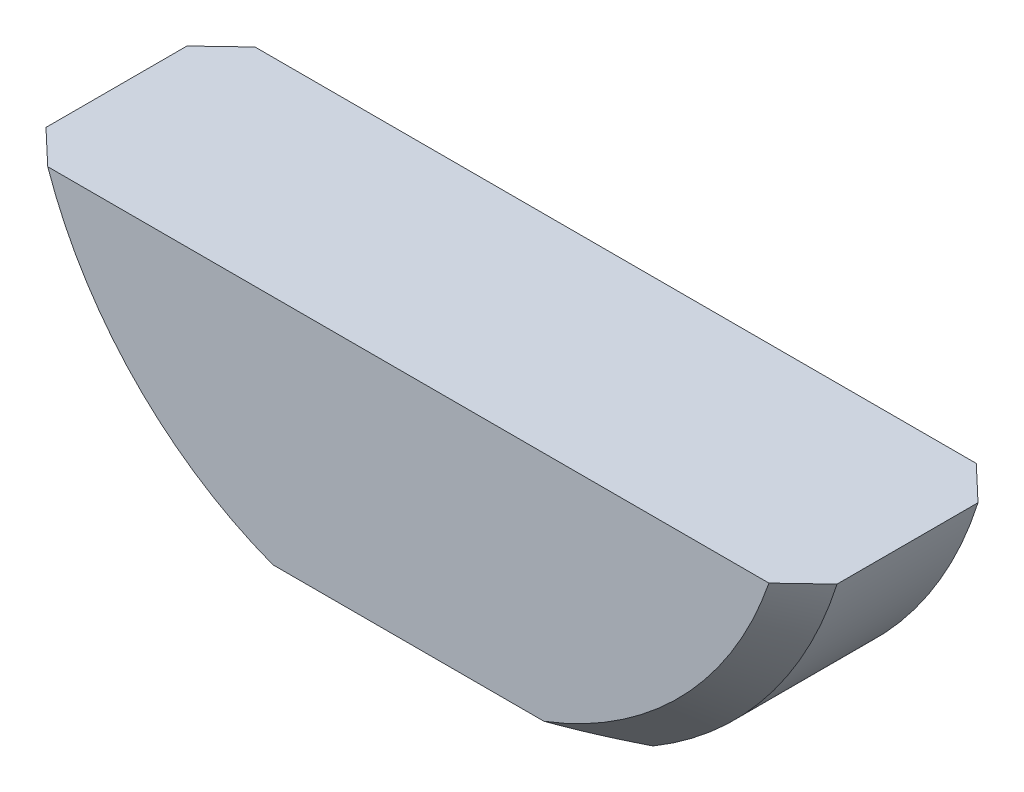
from build123d import *

# Parameters (mm, degrees)
EXTRUDE1_DEPTH          = 1
CUT_EXTRUDE1_DEPTH      = 3.569046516
CUT_EXTRUDE1_DEPTH_BACK = 3.569046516
CHAMFER1_SIZE           = 0.16


with BuildPart() as part:
    # Sketch1 → Extrude1 (new body)
    with BuildSketch(Plane.XY):
        with BuildLine():
            Line((-1.907878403, 0), (1.907878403, 0))
            ThreePointArc((1.907878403, 0), (0, -1.4), (-1.907878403, 0))
        make_face()
    extrude(amount=EXTRUDE1_DEPTH)

    # Sketch2 → Cut-Extrude1 (cut, two sides: drawn at the far end of the back side and taken through both)
    with BuildSketch(Plane.XY.offset(-CUT_EXTRUDE1_DEPTH_BACK)):
        Polygon((-19.861343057, -1.12), (-1.907878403, -1.12), (1.907878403, -1.12), (19.861343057, -1.12), (19.861343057, -37.026929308), (-19.861343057, -37.026929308), align=None)
    extrude(amount=CUT_EXTRUDE1_DEPTH + CUT_EXTRUDE1_DEPTH_BACK, mode=Mode.SUBTRACT)

    # Chamfer1
    chamfer1_edges = [part.edges().sort_by_distance(p)[0] for p in [
        (1.567666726, -0.641942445, 1),
        (-1.567666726, -0.641942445, 0),
        (-1.567666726, -0.641942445, 1),
        (1.567666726, -0.641942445, 0),
    ]]
    chamfer(chamfer1_edges, length=CHAMFER1_SIZE)


solid = part.part
